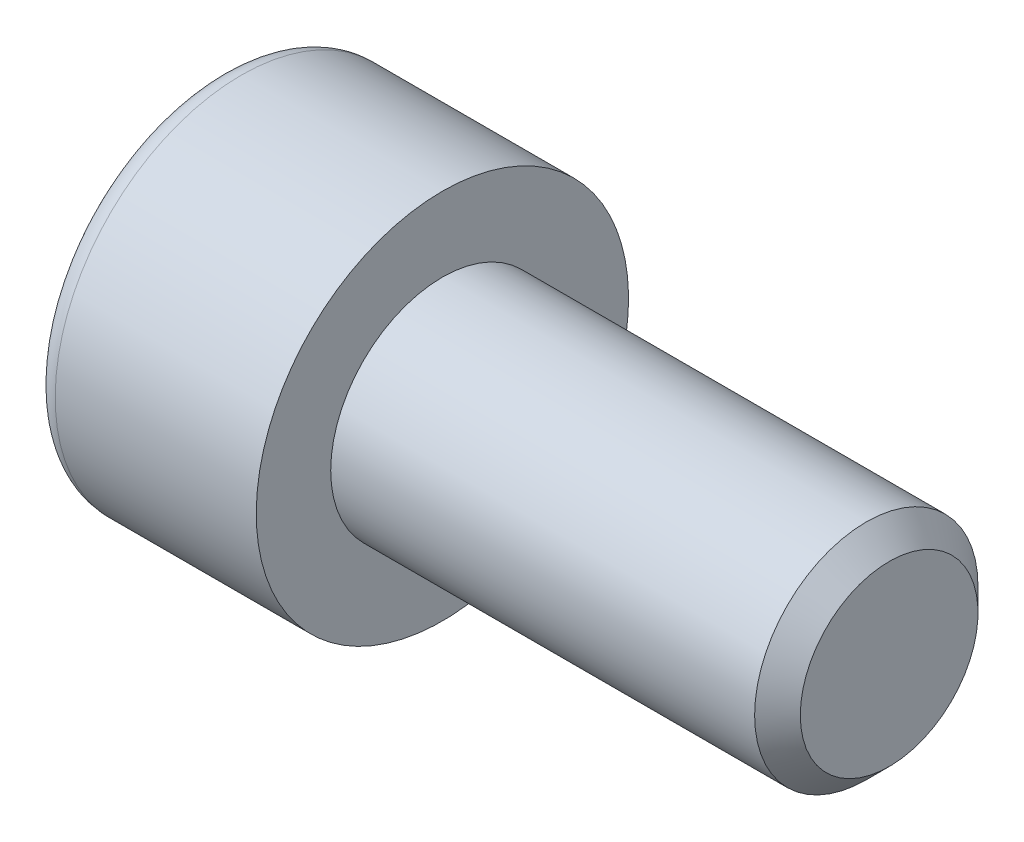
ISO-10303-21;
HEADER;
FILE_DESCRIPTION(('STEP AP214'),'2;1');
FILE_NAME('part.step','',(''),(''),'','','');
FILE_SCHEMA(('AUTOMOTIVE_DESIGN { 1 0 10303 214 1 1 1 1 }'));
ENDSEC;
DATA;
#1=APPLICATION_CONTEXT('core data for automotive mechanical design processes');
#2=APPLICATION_PROTOCOL_DEFINITION('international standard','automotive_design',2000,#1);
#3=PRODUCT_CONTEXT('',#1,'mechanical');
#4=PRODUCT('Part','Part','',(#3));
#5=PRODUCT_RELATED_PRODUCT_CATEGORY('part','',(#4));
#6=PRODUCT_DEFINITION_FORMATION('','',#4);
#7=PRODUCT_DEFINITION_CONTEXT('part definition',#1,'design');
#8=PRODUCT_DEFINITION('design','',#6,#7);
#9=PRODUCT_DEFINITION_SHAPE('','',#8);
#10=(LENGTH_UNIT() NAMED_UNIT(*) SI_UNIT(.MILLI.,.METRE.));
#11=(NAMED_UNIT(*) PLANE_ANGLE_UNIT() SI_UNIT($,.RADIAN.));
#12=(NAMED_UNIT(*) SI_UNIT($,.STERADIAN.) SOLID_ANGLE_UNIT());
#13=UNCERTAINTY_MEASURE_WITH_UNIT(LENGTH_MEASURE(1.E-05),#10,'distance_accuracy_value','');
#14=(GEOMETRIC_REPRESENTATION_CONTEXT(3) GLOBAL_UNCERTAINTY_ASSIGNED_CONTEXT((#13)) GLOBAL_UNIT_ASSIGNED_CONTEXT((#10,
#11,#12)) REPRESENTATION_CONTEXT('',''));
#15=CARTESIAN_POINT('',(0.,0.,0.));
#16=DIRECTION('',(0.,0.,1.));
#17=DIRECTION('',(1.,0.,0.));
#18=AXIS2_PLACEMENT_3D('',#15,#16,#17);
#19=CARTESIAN_POINT('',(-1.33333333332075,-5.6843418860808E-11,0.));
#20=DIRECTION('',(-1.,0.,0.));
#21=DIRECTION('',(0.,0.,1.));
#22=AXIS2_PLACEMENT_3D('',#19,#20,#21);
#23=CONICAL_SURFACE('',#22,0.,1.04719755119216);
#24=CARTESIAN_POINT('',(-1.33333333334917,-5.6843418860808E-11,0.));
#25=VERTEX_POINT('',#24);
#26=VERTEX_LOOP('',#25);
#27=FACE_BOUND('',#26,.T.);
#28=CARTESIAN_POINT('',(-3.00000000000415,-1.04071259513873E-12,-2.88675134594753));
#29=CARTESIAN_POINT('',(-2.96336943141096,-0.10985985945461,-2.82332372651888));
#30=CARTESIAN_POINT('',(-2.9300558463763,-0.220668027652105,-2.75934860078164));
#31=CARTESIAN_POINT('',(-2.87190798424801,-0.444202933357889,-2.63029066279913));
#32=CARTESIAN_POINT('',(-2.84709427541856,-0.556933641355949,-2.56520555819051));
#33=CARTESIAN_POINT('',(-2.80846994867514,-0.780998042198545,-2.43584191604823));
#34=CARTESIAN_POINT('',(-2.79440223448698,-0.892297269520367,-2.37158327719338));
#35=CARTESIAN_POINT('',(-2.77761146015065,-1.11541915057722,-2.24276379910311));
#36=CARTESIAN_POINT('',(-2.77487449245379,-1.22724099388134,-2.17820342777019));
#37=CARTESIAN_POINT('',(-2.78058286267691,-1.43616811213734,-2.05757929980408));
#38=CARTESIAN_POINT('',(-2.78762660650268,-1.53330473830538,-2.00149744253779));
#39=CARTESIAN_POINT('',(-2.80994662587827,-1.72694517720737,-1.88969908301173));
#40=CARTESIAN_POINT('',(-2.82523051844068,-1.82344832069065,-1.83398296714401));
#41=CARTESIAN_POINT('',(-2.86343729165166,-2.01748767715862,-1.72195429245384));
#42=CARTESIAN_POINT('',(-2.88652205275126,-2.11499934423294,-1.66565590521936));
#43=CARTESIAN_POINT('',(-2.93891470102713,-2.30856871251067,-1.55389857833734));
#44=CARTESIAN_POINT('',(-2.96821028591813,-2.40462889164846,-1.49843820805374));
#45=CARTESIAN_POINT('',(-2.99999999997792,-2.50000000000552,-1.44337567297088));
#46=B_SPLINE_CURVE_WITH_KNOTS('',3,(#28,#29,#30,#31,#32,#33,#34,#35,#36,#37,#38,#39,#40,#41,#42,
#43,#44,#45),.UNSPECIFIED.,.F.,.F.,(4,2,2,2,2,2,2,2,4),(0.,0.396270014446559,0.793492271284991,
1.18088450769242,1.56780111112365,1.90463472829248,2.24178024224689,2.58640202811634,
2.93034746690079),.UNSPECIFIED.);
#47=CARTESIAN_POINT('',(-3.00000000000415,0.,-2.88675134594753));
#48=VERTEX_POINT('',#47);
#49=CARTESIAN_POINT('',(-2.99999999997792,-2.50000000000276,-1.44337567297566));
#50=VERTEX_POINT('',#49);
#51=EDGE_CURVE('E127',#48,#50,#46,.T.);
#52=ORIENTED_EDGE('',*,*,#51,.T.);
#53=CARTESIAN_POINT('',(-2.99999999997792,-2.5,-1.44337567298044));
#54=CARTESIAN_POINT('',(-2.96579221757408,-2.5,-1.32488884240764));
#55=CARTESIAN_POINT('',(-2.93447402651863,-2.5,-1.20546467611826));
#56=CARTESIAN_POINT('',(-2.87912300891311,-2.5,-0.96467638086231));
#57=CARTESIAN_POINT('',(-2.85510648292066,-2.5,-0.843308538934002));
#58=CARTESIAN_POINT('',(-2.81648500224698,-2.5,-0.601934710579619));
#59=CARTESIAN_POINT('',(-2.8016741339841,-2.5,-0.481962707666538));
#60=CARTESIAN_POINT('',(-2.78179142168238,-2.5,-0.241326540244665));
#61=CARTESIAN_POINT('',(-2.77670900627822,-2.5,-0.120663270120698));
#62=CARTESIAN_POINT('',(-2.77670900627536,-2.5,0.120663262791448));
#63=CARTESIAN_POINT('',(-2.78179142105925,-2.5,0.241326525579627));
#64=CARTESIAN_POINT('',(-2.80167413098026,-2.5,0.481962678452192));
#65=CARTESIAN_POINT('',(-2.81648499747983,-2.5,0.601934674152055));
#66=CARTESIAN_POINT('',(-2.85510647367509,-2.5,0.843308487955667));
#67=CARTESIAN_POINT('',(-2.87912299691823,-2.5,0.964676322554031));
#68=CARTESIAN_POINT('',(-2.93447400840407,-2.5,1.20546460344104));
#69=CARTESIAN_POINT('',(-2.96579219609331,-2.5,1.3248887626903));
#70=CARTESIAN_POINT('',(-2.99999997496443,-2.5,1.44337558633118));
#71=B_SPLINE_CURVE_WITH_KNOTS('',3,(#53,#54,#55,#56,#57,#58,#59,#60,#61,#62,#63,#64,#65,#66,#67,
#68,#69,#70),.UNSPECIFIED.,.F.,.F.,(4,2,2,2,2,2,2,2,4),(0.,0.370091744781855,0.741003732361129,
1.10328857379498,1.46517951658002,1.82707043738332,2.1893552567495,2.56026722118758,
2.93035894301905),.UNSPECIFIED.);
#72=CARTESIAN_POINT('',(-2.99999999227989,-2.50000001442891,1.44337562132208));
#73=VERTEX_POINT('',#72);
#74=EDGE_CURVE('E279',#50,#73,#71,.T.);
#75=ORIENTED_EDGE('',*,*,#74,.T.);
#76=CARTESIAN_POINT('',(-3.00000000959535,-2.50000002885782,1.44337565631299));
#77=CARTESIAN_POINT('',(-2.96336944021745,-2.39014016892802,1.5068032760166));
#78=CARTESIAN_POINT('',(-2.93005585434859,-2.27933200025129,1.57077840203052));
#79=CARTESIAN_POINT('',(-2.87190799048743,-2.05579709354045,1.6998363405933));
#80=CARTESIAN_POINT('',(-2.84709428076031,-1.94306638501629,1.76492144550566));
#81=CARTESIAN_POINT('',(-2.80846995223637,-1.71900198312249,1.89428508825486));
#82=CARTESIAN_POINT('',(-2.79440223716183,-1.60770275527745,1.95854372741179));
#83=CARTESIAN_POINT('',(-2.77761146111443,-1.38458087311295,2.08736320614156));
#84=CARTESIAN_POINT('',(-2.77487449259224,-1.2727590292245,2.15192357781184));
#85=CARTESIAN_POINT('',(-2.78058286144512,-1.0638319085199,2.27254770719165));
#86=CARTESIAN_POINT('',(-2.78762660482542,-0.966695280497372,2.32862956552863));
#87=CARTESIAN_POINT('',(-2.80994662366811,-0.773054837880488,2.44042792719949));
#88=CARTESIAN_POINT('',(-2.82523051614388,-0.676551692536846,2.49614404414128));
#89=CARTESIAN_POINT('',(-2.86343728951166,-0.482512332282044,2.60817272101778));
#90=CARTESIAN_POINT('',(-2.88652205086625,-0.385000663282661,2.6644711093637));
#91=CARTESIAN_POINT('',(-2.93891469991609,-0.191431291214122,2.77622843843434));
#92=CARTESIAN_POINT('',(-2.96821028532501,-0.095371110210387,2.83168880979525));
#93=CARTESIAN_POINT('',(-2.99999999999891,-1.67818838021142E-11,2.88675134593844));
#94=B_SPLINE_CURVE_WITH_KNOTS('',3,(#76,#77,#78,#79,#80,#81,#82,#83,#84,#85,#86,#87,#88,#89,#90,
#91,#92,#93),.UNSPECIFIED.,.F.,.F.,(4,2,2,2,2,2,2,2,4),(0.,0.396270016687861,0.793492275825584,
1.1808845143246,1.56780111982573,1.90463474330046,2.24178026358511,2.5864020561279,
2.93034750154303),.UNSPECIFIED.);
#95=CARTESIAN_POINT('',(-3.00000000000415,-1.57413289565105E-11,2.88675134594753));
#96=VERTEX_POINT('',#95);
#97=EDGE_CURVE('E287',#73,#96,#94,.T.);
#98=ORIENTED_EDGE('',*,*,#97,.T.);
#99=CARTESIAN_POINT('',(-3.00000000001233,-1.63942558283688E-11,2.88675134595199));
#100=CARTESIAN_POINT('',(-2.963369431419,0.109859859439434,2.82332372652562));
#101=CARTESIAN_POINT('',(-2.93005584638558,0.220668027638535,2.75934860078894));
#102=CARTESIAN_POINT('',(-2.87190798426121,0.444202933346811,2.63029066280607));
#103=CARTESIAN_POINT('',(-2.84709427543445,0.556933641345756,2.56520555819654));
#104=CARTESIAN_POINT('',(-2.80846994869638,0.780998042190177,2.43584191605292));
#105=CARTESIAN_POINT('',(-2.7944022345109,0.892297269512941,2.37158327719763));
#106=CARTESIAN_POINT('',(-2.7776114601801,1.11541915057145,2.24276379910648));
#107=CARTESIAN_POINT('',(-2.77487449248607,1.22724099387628,2.17820342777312));
#108=CARTESIAN_POINT('',(-2.78058286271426,1.43616811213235,2.05757929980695));
#109=CARTESIAN_POINT('',(-2.78762660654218,1.53330473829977,2.00149744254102));
#110=CARTESIAN_POINT('',(-2.80994662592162,1.72694517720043,1.88969908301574));
#111=CARTESIAN_POINT('',(-2.82523051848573,1.82344832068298,1.83398296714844));
#112=CARTESIAN_POINT('',(-2.86343729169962,2.01748767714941,1.72195429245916));
#113=CARTESIAN_POINT('',(-2.88652205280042,2.11499934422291,1.66565590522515));
#114=CARTESIAN_POINT('',(-2.93891470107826,2.30856871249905,1.55389857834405));
#115=CARTESIAN_POINT('',(-2.96821028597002,2.40462889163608,1.49843820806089));
#116=CARTESIAN_POINT('',(-3.00000000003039,2.4999999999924,1.44337567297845));
#117=B_SPLINE_CURVE_WITH_KNOTS('',3,(#99,#100,#101,#102,#103,#104,#105,#106,#107,#108,#109,#110,
#111,#112,#113,#114,#115,#116),.UNSPECIFIED.,.F.,.F.,(4,2,2,2,2,2,2,2,4),(0.,0.39627001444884,
0.793492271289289,1.18088450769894,1.5678011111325,1.90463472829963,2.24178024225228,
2.5864020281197,2.9303474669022),.UNSPECIFIED.);
#118=CARTESIAN_POINT('',(-3.00000000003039,2.4999999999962,1.44337567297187));
#119=VERTEX_POINT('',#118);
#120=EDGE_CURVE('E290',#96,#119,#117,.T.);
#121=ORIENTED_EDGE('',*,*,#120,.T.);
#122=CARTESIAN_POINT('',(-3.00000000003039,2.5,1.44337567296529));
#123=CARTESIAN_POINT('',(-2.96579221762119,2.5,1.32488884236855));
#124=CARTESIAN_POINT('',(-2.93447402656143,2.5,1.20546467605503));
#125=CARTESIAN_POINT('',(-2.87912300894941,2.5,0.964676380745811));
#126=CARTESIAN_POINT('',(-2.85510648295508,2.5,0.843308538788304));
#127=CARTESIAN_POINT('',(-2.8164850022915,2.5,0.601934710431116));
#128=CARTESIAN_POINT('',(-2.8016741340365,2.5,0.481962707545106));
#129=CARTESIAN_POINT('',(-2.78179142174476,2.5,0.241326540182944));
#130=CARTESIAN_POINT('',(-2.77670900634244,2.5,0.120663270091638));
#131=CARTESIAN_POINT('',(-2.77670900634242,2.5,-0.12066327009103));
#132=CARTESIAN_POINT('',(-2.78179142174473,2.5,-0.241326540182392));
#133=CARTESIAN_POINT('',(-2.80167413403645,2.5,-0.481962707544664));
#134=CARTESIAN_POINT('',(-2.81648500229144,2.5,-0.601934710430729));
#135=CARTESIAN_POINT('',(-2.85510648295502,2.5,-0.84330853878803));
#136=CARTESIAN_POINT('',(-2.87912300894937,2.5,-0.964676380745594));
#137=CARTESIAN_POINT('',(-2.9344740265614,2.5,-1.20546467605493));
#138=CARTESIAN_POINT('',(-2.96579221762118,2.5,-1.3248888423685));
#139=CARTESIAN_POINT('',(-3.00000000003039,2.5,-1.44337567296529));
#140=B_SPLINE_CURVE_WITH_KNOTS('',3,(#122,#123,#124,#125,#126,#127,#128,#129,#130,#131,#132,
#133,#134,#135,#136,#137,#138,#139),.UNSPECIFIED.,.F.,.F.,(4,2,2,2,2,2,2,2,4),(0.,
0.370091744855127,0.741003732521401,1.10328857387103,1.46517951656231,1.82707045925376,
2.18935530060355,2.56026728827,2.93035903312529),.UNSPECIFIED.);
#141=CARTESIAN_POINT('',(-3.00000000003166,2.5,-1.44337567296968));
#142=VERTEX_POINT('',#141);
#143=EDGE_CURVE('E21',#119,#142,#140,.T.);
#144=ORIENTED_EDGE('',*,*,#143,.T.);
#145=CARTESIAN_POINT('',(-3.00000000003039,2.4999999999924,-1.44337567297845));
#146=CARTESIAN_POINT('',(-2.96336943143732,2.39014014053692,-1.50680329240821));
#147=CARTESIAN_POINT('',(-2.93005584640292,2.2793319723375,-1.57077841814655));
#148=CARTESIAN_POINT('',(-2.87190798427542,2.05579706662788,-1.69983635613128));
#149=CARTESIAN_POINT('',(-2.8470942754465,1.94306635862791,-1.764921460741));
#150=CARTESIAN_POINT('',(-2.80846994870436,1.7190019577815,-1.89428510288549));
#151=CARTESIAN_POINT('',(-2.79440223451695,1.60770273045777,-1.95854374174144));
#152=CARTESIAN_POINT('',(-2.77761146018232,1.38458084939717,-2.08736321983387));
#153=CARTESIAN_POINT('',(-2.7748744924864,1.2727590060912,-2.15192359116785));
#154=CARTESIAN_POINT('',(-2.78058286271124,1.06383188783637,-2.27254771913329));
#155=CARTESIAN_POINT('',(-2.78762660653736,0.966695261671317,-2.32862957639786));
#156=CARTESIAN_POINT('',(-2.80994662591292,0.77305482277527,-2.44042793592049));
#157=CARTESIAN_POINT('',(-2.82523051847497,0.676551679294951,-2.4961440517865));
#158=CARTESIAN_POINT('',(-2.86343729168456,0.482512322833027,-2.60817272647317));
#159=CARTESIAN_POINT('',(-2.88652205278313,0.385000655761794,-2.66447111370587));
#160=CARTESIAN_POINT('',(-2.93891470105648,0.191431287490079,-2.77622844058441));
#161=CARTESIAN_POINT('',(-2.96821028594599,0.095371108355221,-2.83168881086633));
#162=CARTESIAN_POINT('',(-3.00000000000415,1.04046137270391E-12,-2.88675134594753));
#163=B_SPLINE_CURVE_WITH_KNOTS('',3,(#145,#146,#147,#148,#149,#150,#151,#152,#153,#154,#155,
#156,#157,#158,#159,#160,#161,#162),.UNSPECIFIED.,.F.,.F.,(4,2,2,2,2,2,2,2,4),(0.,
0.396270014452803,0.793492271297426,1.18088450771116,1.56780111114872,1.90463472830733,
2.24178024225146,2.58640202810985,2.93034746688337),.UNSPECIFIED.);
#164=EDGE_CURVE('E91',#142,#48,#163,.T.);
#165=ORIENTED_EDGE('',*,*,#164,.T.);
#166=EDGE_LOOP('',(#52,#75,#98,#121,#144,#165));
#167=FACE_BOUND('',#166,.T.);
#168=ADVANCED_FACE('F17',(#27,#167),#23,.F.);
#169=CARTESIAN_POINT('',(-6.,2.5,1.44337567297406));
#170=DIRECTION('',(0.,1.,0.));
#171=DIRECTION('',(0.,0.,1.));
#172=AXIS2_PLACEMENT_3D('',#169,#170,#171);
#173=PLANE('',#172);
#174=DIRECTION('',(1.,0.,0.));
#175=VECTOR('',#174,1.);
#176=CARTESIAN_POINT('',(-6.,2.5,1.44337567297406));
#177=LINE('',#176,#175);
#178=CARTESIAN_POINT('',(-6.,2.5,1.44337567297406));
#179=VERTEX_POINT('',#178);
#180=EDGE_CURVE('E85',#119,#179,#177,.F.);
#181=ORIENTED_EDGE('',*,*,#180,.T.);
#182=DIRECTION('',(0.,0.,1.));
#183=VECTOR('',#182,1.);
#184=CARTESIAN_POINT('',(-6.,2.5,0.));
#185=LINE('',#184,#183);
#186=CARTESIAN_POINT('',(-6.,2.5,-1.44337567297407));
#187=VERTEX_POINT('',#186);
#188=EDGE_CURVE('E79',#187,#179,#185,.T.);
#189=ORIENTED_EDGE('',*,*,#188,.F.);
#190=DIRECTION('',(1.,0.,0.));
#191=VECTOR('',#190,1.);
#192=CARTESIAN_POINT('',(-6.,2.5,-1.44337567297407));
#193=LINE('',#192,#191);
#194=EDGE_CURVE('E82',#187,#142,#193,.T.);
#195=ORIENTED_EDGE('',*,*,#194,.T.);
#196=ORIENTED_EDGE('',*,*,#143,.F.);
#197=EDGE_LOOP('',(#181,#189,#195,#196));
#198=FACE_BOUND('',#197,.T.);
#199=ADVANCED_FACE('F81',(#198),#173,.F.);
#200=CARTESIAN_POINT('',(-6.,0.,2.88675134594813));
#201=DIRECTION('',(0.,0.500000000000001,0.866025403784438));
#202=DIRECTION('',(0.,-0.866025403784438,0.500000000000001));
#203=AXIS2_PLACEMENT_3D('',#200,#201,#202);
#204=PLANE('',#203);
#205=DIRECTION('',(1.,0.,0.));
#206=VECTOR('',#205,1.);
#207=CARTESIAN_POINT('',(-6.,0.,2.88675134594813));
#208=LINE('',#207,#206);
#209=CARTESIAN_POINT('',(-6.,0.,2.88675134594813));
#210=VERTEX_POINT('',#209);
#211=EDGE_CURVE('E288',#96,#210,#208,.F.);
#212=ORIENTED_EDGE('',*,*,#211,.T.);
#213=DIRECTION('',(0.,-0.866025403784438,0.500000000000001));
#214=VECTOR('',#213,1.);
#215=CARTESIAN_POINT('',(-6.,2.5,1.44337567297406));
#216=LINE('',#215,#214);
#217=EDGE_CURVE('E90',#179,#210,#216,.T.);
#218=ORIENTED_EDGE('',*,*,#217,.F.);
#219=ORIENTED_EDGE('',*,*,#180,.F.);
#220=ORIENTED_EDGE('',*,*,#120,.F.);
#221=EDGE_LOOP('',(#212,#218,#219,#220));
#222=FACE_BOUND('',#221,.T.);
#223=ADVANCED_FACE('F254',(#222),#204,.F.);
#224=CARTESIAN_POINT('',(-6.,-2.5,1.44337567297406));
#225=DIRECTION('',(0.,-0.5,0.866025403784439));
#226=DIRECTION('',(0.,-0.866025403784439,-0.5));
#227=AXIS2_PLACEMENT_3D('',#224,#225,#226);
#228=PLANE('',#227);
#229=DIRECTION('',(1.,0.,0.));
#230=VECTOR('',#229,1.);
#231=CARTESIAN_POINT('',(-6.,-2.5,1.44337567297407));
#232=LINE('',#231,#230);
#233=CARTESIAN_POINT('',(-6.,-2.5,1.44337567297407));
#234=VERTEX_POINT('',#233);
#235=EDGE_CURVE('E284',#73,#234,#232,.F.);
#236=ORIENTED_EDGE('',*,*,#235,.T.);
#237=DIRECTION('',(0.,-0.866025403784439,-0.5));
#238=VECTOR('',#237,1.);
#239=CARTESIAN_POINT('',(-6.,0.,2.88675134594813));
#240=LINE('',#239,#238);
#241=EDGE_CURVE('E110',#210,#234,#240,.T.);
#242=ORIENTED_EDGE('',*,*,#241,.F.);
#243=ORIENTED_EDGE('',*,*,#211,.F.);
#244=ORIENTED_EDGE('',*,*,#97,.F.);
#245=EDGE_LOOP('',(#236,#242,#243,#244));
#246=FACE_BOUND('',#245,.T.);
#247=ADVANCED_FACE('F247',(#246),#228,.F.);
#248=CARTESIAN_POINT('',(-6.,-2.5,-1.44337567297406));
#249=DIRECTION('',(0.,-1.,0.));
#250=DIRECTION('',(0.,0.,-1.));
#251=AXIS2_PLACEMENT_3D('',#248,#249,#250);
#252=PLANE('',#251);
#253=DIRECTION('',(1.,0.,0.));
#254=VECTOR('',#253,1.);
#255=CARTESIAN_POINT('',(-6.,-2.5,-1.44337567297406));
#256=LINE('',#255,#254);
#257=CARTESIAN_POINT('',(-6.,-2.5,-1.44337567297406));
#258=VERTEX_POINT('',#257);
#259=EDGE_CURVE('E281',#50,#258,#256,.F.);
#260=ORIENTED_EDGE('',*,*,#259,.T.);
#261=DIRECTION('',(0.,0.,1.));
#262=VECTOR('',#261,1.);
#263=CARTESIAN_POINT('',(-6.,-2.5,0.));
#264=LINE('',#263,#262);
#265=EDGE_CURVE('E105',#234,#258,#264,.F.);
#266=ORIENTED_EDGE('',*,*,#265,.F.);
#267=ORIENTED_EDGE('',*,*,#235,.F.);
#268=ORIENTED_EDGE('',*,*,#74,.F.);
#269=EDGE_LOOP('',(#260,#266,#267,#268));
#270=FACE_BOUND('',#269,.T.);
#271=ADVANCED_FACE('F241',(#270),#252,.F.);
#272=CARTESIAN_POINT('',(-6.,0.,-2.88675134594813));
#273=DIRECTION('',(0.,-0.5,-0.866025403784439));
#274=DIRECTION('',(0.,0.866025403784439,-0.5));
#275=AXIS2_PLACEMENT_3D('',#272,#273,#274);
#276=PLANE('',#275);
#277=DIRECTION('',(1.,0.,0.));
#278=VECTOR('',#277,1.);
#279=CARTESIAN_POINT('',(-6.,0.,-2.88675134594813));
#280=LINE('',#279,#278);
#281=CARTESIAN_POINT('',(-6.,0.,-2.88675134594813));
#282=VERTEX_POINT('',#281);
#283=EDGE_CURVE('E41',#48,#282,#280,.F.);
#284=ORIENTED_EDGE('',*,*,#283,.T.);
#285=DIRECTION('',(0.,0.866025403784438,-0.5));
#286=VECTOR('',#285,1.);
#287=CARTESIAN_POINT('',(-6.,-2.5,-1.44337567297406));
#288=LINE('',#287,#286);
#289=EDGE_CURVE('E100',#258,#282,#288,.T.);
#290=ORIENTED_EDGE('',*,*,#289,.F.);
#291=ORIENTED_EDGE('',*,*,#259,.F.);
#292=ORIENTED_EDGE('',*,*,#51,.F.);
#293=EDGE_LOOP('',(#284,#290,#291,#292));
#294=FACE_BOUND('',#293,.T.);
#295=ADVANCED_FACE('F137',(#294),#276,.F.);
#296=CARTESIAN_POINT('',(-6.,2.5,-1.44337567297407));
#297=DIRECTION('',(0.,0.5,-0.866025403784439));
#298=DIRECTION('',(0.,0.866025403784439,0.5));
#299=AXIS2_PLACEMENT_3D('',#296,#297,#298);
#300=PLANE('',#299);
#301=ORIENTED_EDGE('',*,*,#194,.F.);
#302=DIRECTION('',(0.,0.866025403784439,0.5));
#303=VECTOR('',#302,1.);
#304=CARTESIAN_POINT('',(-6.,0.,-2.88675134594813));
#305=LINE('',#304,#303);
#306=EDGE_CURVE('E95',#282,#187,#305,.T.);
#307=ORIENTED_EDGE('',*,*,#306,.F.);
#308=ORIENTED_EDGE('',*,*,#283,.F.);
#309=ORIENTED_EDGE('',*,*,#164,.F.);
#310=EDGE_LOOP('',(#301,#307,#308,#309));
#311=FACE_BOUND('',#310,.T.);
#312=ADVANCED_FACE('F94',(#311),#300,.F.);
#313=CARTESIAN_POINT('',(-6.,3.94337567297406,0.));
#314=DIRECTION('',(-1.,0.,0.));
#315=DIRECTION('',(0.,-1.,0.));
#316=AXIS2_PLACEMENT_3D('',#313,#314,#315);
#317=PLANE('',#316);
#318=CARTESIAN_POINT('',(-6.,0.,0.));
#319=DIRECTION('',(1.,0.,0.));
#320=DIRECTION('',(0.,1.,0.));
#321=AXIS2_PLACEMENT_3D('',#318,#319,#320);
#322=CIRCLE('',#321,4.4);
#323=CARTESIAN_POINT('',(-6.,4.4,0.));
#324=VERTEX_POINT('',#323);
#325=EDGE_CURVE('E101',#324,#324,#322,.T.);
#326=ORIENTED_EDGE('',*,*,#325,.F.);
#327=EDGE_LOOP('',(#326));
#328=FACE_BOUND('',#327,.T.);
#329=ORIENTED_EDGE('',*,*,#289,.T.);
#330=ORIENTED_EDGE('',*,*,#306,.T.);
#331=ORIENTED_EDGE('',*,*,#188,.T.);
#332=ORIENTED_EDGE('',*,*,#217,.T.);
#333=ORIENTED_EDGE('',*,*,#241,.T.);
#334=ORIENTED_EDGE('',*,*,#265,.T.);
#335=EDGE_LOOP('',(#329,#330,#331,#332,#333,#334));
#336=FACE_BOUND('',#335,.T.);
#337=ADVANCED_FACE('F98',(#328,#336),#317,.T.);
#338=CARTESIAN_POINT('',(-5.4,0.,0.));
#339=DIRECTION('',(1.,0.,0.));
#340=DIRECTION('',(0.,0.,-1.));
#341=AXIS2_PLACEMENT_3D('',#338,#339,#340);
#342=TOROIDAL_SURFACE('',#341,4.4,0.6);
#343=CARTESIAN_POINT('',(-5.4,0.,0.));
#344=DIRECTION('',(1.,0.,0.));
#345=DIRECTION('',(0.,1.,0.));
#346=AXIS2_PLACEMENT_3D('',#343,#344,#345);
#347=CIRCLE('',#346,5.);
#348=CARTESIAN_POINT('',(-5.4,5.,0.));
#349=VERTEX_POINT('',#348);
#350=EDGE_CURVE('E104',#349,#349,#347,.T.);
#351=ORIENTED_EDGE('',*,*,#350,.F.);
#352=EDGE_LOOP('',(#351));
#353=FACE_BOUND('',#352,.T.);
#354=ORIENTED_EDGE('',*,*,#325,.T.);
#355=EDGE_LOOP('',(#354));
#356=FACE_BOUND('',#355,.T.);
#357=ADVANCED_FACE('F143',(#353,#356),#342,.T.);
#358=CARTESIAN_POINT('',(-3.,0.,0.));
#359=DIRECTION('',(1.,0.,0.));
#360=DIRECTION('',(0.,1.,0.));
#361=AXIS2_PLACEMENT_3D('',#358,#359,#360);
#362=CYLINDRICAL_SURFACE('',#361,5.);
#363=CARTESIAN_POINT('',(0.,0.,0.));
#364=DIRECTION('',(1.,0.,0.));
#365=DIRECTION('',(0.,1.,0.));
#366=AXIS2_PLACEMENT_3D('',#363,#364,#365);
#367=CIRCLE('',#366,5.);
#368=CARTESIAN_POINT('',(0.,5.,0.));
#369=VERTEX_POINT('',#368);
#370=EDGE_CURVE('E119',#369,#369,#367,.T.);
#371=ORIENTED_EDGE('',*,*,#370,.F.);
#372=EDGE_LOOP('',(#371));
#373=FACE_BOUND('',#372,.T.);
#374=ORIENTED_EDGE('',*,*,#350,.T.);
#375=EDGE_LOOP('',(#374));
#376=FACE_BOUND('',#375,.T.);
#377=ADVANCED_FACE('F172',(#373,#376),#362,.T.);
#378=CARTESIAN_POINT('',(12.,1.5,0.));
#379=DIRECTION('',(1.,0.,0.));
#380=DIRECTION('',(0.,0.,-1.));
#381=AXIS2_PLACEMENT_3D('',#378,#379,#380);
#382=PLANE('',#381);
#383=CARTESIAN_POINT('',(12.0000000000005,0.,0.));
#384=DIRECTION('',(-1.,0.,0.));
#385=DIRECTION('',(0.,0.,1.));
#386=AXIS2_PLACEMENT_3D('',#383,#384,#385);
#387=CIRCLE('',#386,2.38655000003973);
#388=CARTESIAN_POINT('',(12.0000000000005,0.,2.38655000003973));
#389=VERTEX_POINT('',#388);
#390=EDGE_CURVE('E116',#389,#389,#387,.T.);
#391=ORIENTED_EDGE('',*,*,#390,.F.);
#392=EDGE_LOOP('',(#391));
#393=FACE_BOUND('',#392,.T.);
#394=ADVANCED_FACE('F178',(#393),#382,.T.);
#395=CARTESIAN_POINT('',(0.,4.,0.));
#396=DIRECTION('',(1.,0.,0.));
#397=DIRECTION('',(0.,0.,-1.));
#398=AXIS2_PLACEMENT_3D('',#395,#396,#397);
#399=PLANE('',#398);
#400=ORIENTED_EDGE('',*,*,#370,.T.);
#401=EDGE_LOOP('',(#400));
#402=FACE_BOUND('',#401,.T.);
#403=CARTESIAN_POINT('',(0.,0.,0.));
#404=DIRECTION('',(1.,0.,0.));
#405=DIRECTION('',(0.,1.,0.));
#406=AXIS2_PLACEMENT_3D('',#403,#404,#405);
#407=CIRCLE('',#406,3.);
#408=CARTESIAN_POINT('',(0.,3.,0.));
#409=VERTEX_POINT('',#408);
#410=EDGE_CURVE('E32',#409,#409,#407,.T.);
#411=ORIENTED_EDGE('',*,*,#410,.F.);
#412=EDGE_LOOP('',(#411));
#413=FACE_BOUND('',#412,.T.);
#414=ADVANCED_FACE('F187',(#402,#413),#399,.T.);
#415=CARTESIAN_POINT('',(11.3865500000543,0.,0.));
#416=DIRECTION('',(-1.,0.,0.));
#417=DIRECTION('',(0.,0.,1.));
#418=AXIS2_PLACEMENT_3D('',#415,#416,#417);
#419=CONICAL_SURFACE('',#418,2.9999999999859,0.785398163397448);
#420=CARTESIAN_POINT('',(11.38655,0.,0.));
#421=DIRECTION('',(1.,0.,0.));
#422=DIRECTION('',(0.,1.,0.));
#423=AXIS2_PLACEMENT_3D('',#420,#421,#422);
#424=CIRCLE('',#423,3.);
#425=CARTESIAN_POINT('',(11.38655,3.,0.));
#426=VERTEX_POINT('',#425);
#427=EDGE_CURVE('E11',#426,#426,#424,.F.);
#428=ORIENTED_EDGE('',*,*,#427,.F.);
#429=EDGE_LOOP('',(#428));
#430=FACE_BOUND('',#429,.T.);
#431=ORIENTED_EDGE('',*,*,#390,.T.);
#432=EDGE_LOOP('',(#431));
#433=FACE_BOUND('',#432,.T.);
#434=ADVANCED_FACE('F182',(#430,#433),#419,.T.);
#435=CARTESIAN_POINT('',(7.25,0.,0.));
#436=DIRECTION('',(1.,0.,0.));
#437=DIRECTION('',(0.,1.,0.));
#438=AXIS2_PLACEMENT_3D('',#435,#436,#437);
#439=CYLINDRICAL_SURFACE('',#438,3.);
#440=ORIENTED_EDGE('',*,*,#410,.T.);
#441=EDGE_LOOP('',(#440));
#442=FACE_BOUND('',#441,.T.);
#443=ORIENTED_EDGE('',*,*,#427,.T.);
#444=EDGE_LOOP('',(#443));
#445=FACE_BOUND('',#444,.T.);
#446=ADVANCED_FACE('F19',(#442,#445),#439,.T.);
#447=CLOSED_SHELL('',(#168,#199,#223,#247,#271,#295,#312,#337,#357,#377,#394,#414,#434,#446));
#448=MANIFOLD_SOLID_BREP('B1',#447);
#449=ADVANCED_BREP_SHAPE_REPRESENTATION('',(#18,#448),#14);
#450=SHAPE_DEFINITION_REPRESENTATION(#9,#449);
ENDSEC;
END-ISO-10303-21;
